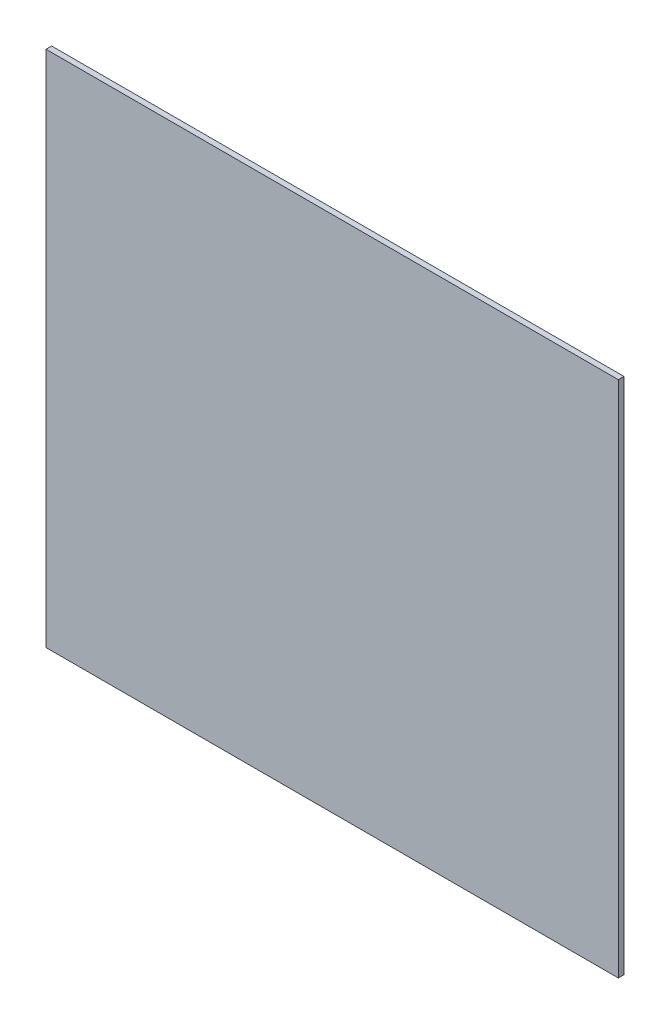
ISO-10303-21;
HEADER;
FILE_DESCRIPTION(('STEP AP214'),'2;1');
FILE_NAME('part.step','',(''),(''),'','','');
FILE_SCHEMA(('AUTOMOTIVE_DESIGN { 1 0 10303 214 1 1 1 1 }'));
ENDSEC;
DATA;
#1=APPLICATION_CONTEXT('core data for automotive mechanical design processes');
#2=APPLICATION_PROTOCOL_DEFINITION('international standard','automotive_design',2000,#1);
#3=PRODUCT_CONTEXT('',#1,'mechanical');
#4=PRODUCT('Part','Part','',(#3));
#5=PRODUCT_RELATED_PRODUCT_CATEGORY('part','',(#4));
#6=PRODUCT_DEFINITION_FORMATION('','',#4);
#7=PRODUCT_DEFINITION_CONTEXT('part definition',#1,'design');
#8=PRODUCT_DEFINITION('design','',#6,#7);
#9=PRODUCT_DEFINITION_SHAPE('','',#8);
#10=(LENGTH_UNIT() NAMED_UNIT(*) SI_UNIT(.MILLI.,.METRE.));
#11=(NAMED_UNIT(*) PLANE_ANGLE_UNIT() SI_UNIT($,.RADIAN.));
#12=(NAMED_UNIT(*) SI_UNIT($,.STERADIAN.) SOLID_ANGLE_UNIT());
#13=UNCERTAINTY_MEASURE_WITH_UNIT(LENGTH_MEASURE(1.E-05),#10,'distance_accuracy_value','');
#14=(GEOMETRIC_REPRESENTATION_CONTEXT(3) GLOBAL_UNCERTAINTY_ASSIGNED_CONTEXT((#13)) GLOBAL_UNIT_ASSIGNED_CONTEXT((#10,
#11,#12)) REPRESENTATION_CONTEXT('',''));
#15=CARTESIAN_POINT('',(0.,0.,0.));
#16=DIRECTION('',(0.,0.,1.));
#17=DIRECTION('',(1.,0.,0.));
#18=AXIS2_PLACEMENT_3D('',#15,#16,#17);
#19=CARTESIAN_POINT('',(-522.852943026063,-701.846010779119,10.));
#20=DIRECTION('',(-1.,0.,0.));
#21=DIRECTION('',(0.,0.,1.));
#22=AXIS2_PLACEMENT_3D('',#19,#20,#21);
#23=PLANE('',#22);
#24=DIRECTION('',(0.,1.,0.));
#25=VECTOR('',#24,1.);
#26=CARTESIAN_POINT('',(-522.852943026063,-701.846010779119,0.));
#27=LINE('',#26,#25);
#28=CARTESIAN_POINT('',(-522.852943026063,-701.846010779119,0.));
#29=VERTEX_POINT('',#28);
#30=CARTESIAN_POINT('',(-522.852943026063,217.153989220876,0.));
#31=VERTEX_POINT('',#30);
#32=EDGE_CURVE('E94',#29,#31,#27,.T.);
#33=ORIENTED_EDGE('',*,*,#32,.T.);
#34=DIRECTION('',(0.,0.,-1.));
#35=VECTOR('',#34,1.);
#36=CARTESIAN_POINT('',(-522.852943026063,217.153989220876,10.));
#37=LINE('',#36,#35);
#38=CARTESIAN_POINT('',(-522.852943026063,217.153989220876,10.));
#39=VERTEX_POINT('',#38);
#40=EDGE_CURVE('E11',#39,#31,#37,.T.);
#41=ORIENTED_EDGE('',*,*,#40,.F.);
#42=DIRECTION('',(0.,1.,0.));
#43=VECTOR('',#42,1.);
#44=CARTESIAN_POINT('',(-522.852943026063,-701.846010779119,10.));
#45=LINE('',#44,#43);
#46=CARTESIAN_POINT('',(-522.852943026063,-701.846010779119,10.));
#47=VERTEX_POINT('',#46);
#48=EDGE_CURVE('E82',#47,#39,#45,.T.);
#49=ORIENTED_EDGE('',*,*,#48,.F.);
#50=DIRECTION('',(0.,0.,-1.));
#51=VECTOR('',#50,1.);
#52=CARTESIAN_POINT('',(-522.852943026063,-701.846010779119,10.));
#53=LINE('',#52,#51);
#54=EDGE_CURVE('E90',#47,#29,#53,.T.);
#55=ORIENTED_EDGE('',*,*,#54,.T.);
#56=EDGE_LOOP('',(#33,#41,#49,#55));
#57=FACE_BOUND('',#56,.T.);
#58=ADVANCED_FACE('F31',(#57),#23,.F.);
#59=CARTESIAN_POINT('',(-522.852943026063,217.153989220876,10.));
#60=DIRECTION('',(0.,-1.,0.));
#61=DIRECTION('',(1.,0.,0.));
#62=AXIS2_PLACEMENT_3D('',#59,#60,#61);
#63=PLANE('',#62);
#64=DIRECTION('',(-1.,0.,0.));
#65=VECTOR('',#64,1.);
#66=CARTESIAN_POINT('',(-522.852943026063,217.153989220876,0.));
#67=LINE('',#66,#65);
#68=CARTESIAN_POINT('',(-1537.85294302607,217.153989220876,0.));
#69=VERTEX_POINT('',#68);
#70=EDGE_CURVE('E86',#31,#69,#67,.T.);
#71=ORIENTED_EDGE('',*,*,#70,.T.);
#72=DIRECTION('',(0.,0.,-1.));
#73=VECTOR('',#72,1.);
#74=CARTESIAN_POINT('',(-1537.85294302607,217.153989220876,10.));
#75=LINE('',#74,#73);
#76=CARTESIAN_POINT('',(-1537.85294302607,217.153989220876,10.));
#77=VERTEX_POINT('',#76);
#78=EDGE_CURVE('E39',#77,#69,#75,.T.);
#79=ORIENTED_EDGE('',*,*,#78,.F.);
#80=DIRECTION('',(-1.,0.,0.));
#81=VECTOR('',#80,1.);
#82=CARTESIAN_POINT('',(-522.852943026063,217.153989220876,10.));
#83=LINE('',#82,#81);
#84=EDGE_CURVE('E77',#39,#77,#83,.T.);
#85=ORIENTED_EDGE('',*,*,#84,.F.);
#86=ORIENTED_EDGE('',*,*,#40,.T.);
#87=EDGE_LOOP('',(#71,#79,#85,#86));
#88=FACE_BOUND('',#87,.T.);
#89=ADVANCED_FACE('F85',(#88),#63,.F.);
#90=CARTESIAN_POINT('',(-1537.85294302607,-701.846010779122,10.));
#91=DIRECTION('',(1.,0.,0.));
#92=DIRECTION('',(0.,0.,-1.));
#93=AXIS2_PLACEMENT_3D('',#90,#91,#92);
#94=PLANE('',#93);
#95=DIRECTION('',(0.,-1.,0.));
#96=VECTOR('',#95,1.);
#97=CARTESIAN_POINT('',(-1537.85294302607,-701.846010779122,0.));
#98=LINE('',#97,#96);
#99=CARTESIAN_POINT('',(-1537.85294302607,-701.846010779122,0.));
#100=VERTEX_POINT('',#99);
#101=EDGE_CURVE('E64',#69,#100,#98,.T.);
#102=ORIENTED_EDGE('',*,*,#101,.T.);
#103=DIRECTION('',(0.,0.,-1.));
#104=VECTOR('',#103,1.);
#105=CARTESIAN_POINT('',(-1537.85294302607,-701.846010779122,10.));
#106=LINE('',#105,#104);
#107=CARTESIAN_POINT('',(-1537.85294302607,-701.846010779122,10.));
#108=VERTEX_POINT('',#107);
#109=EDGE_CURVE('E87',#108,#100,#106,.T.);
#110=ORIENTED_EDGE('',*,*,#109,.F.);
#111=DIRECTION('',(0.,-1.,0.));
#112=VECTOR('',#111,1.);
#113=CARTESIAN_POINT('',(-1537.85294302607,-701.846010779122,10.));
#114=LINE('',#113,#112);
#115=EDGE_CURVE('E80',#77,#108,#114,.T.);
#116=ORIENTED_EDGE('',*,*,#115,.F.);
#117=ORIENTED_EDGE('',*,*,#78,.T.);
#118=EDGE_LOOP('',(#102,#110,#116,#117));
#119=FACE_BOUND('',#118,.T.);
#120=ADVANCED_FACE('F88',(#119),#94,.F.);
#121=CARTESIAN_POINT('',(-522.852943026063,-701.846010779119,10.));
#122=DIRECTION('',(0.,1.,0.));
#123=DIRECTION('',(-1.,0.,0.));
#124=AXIS2_PLACEMENT_3D('',#121,#122,#123);
#125=PLANE('',#124);
#126=DIRECTION('',(1.,0.,0.));
#127=VECTOR('',#126,1.);
#128=CARTESIAN_POINT('',(-522.852943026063,-701.846010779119,0.));
#129=LINE('',#128,#127);
#130=EDGE_CURVE('E70',#100,#29,#129,.T.);
#131=ORIENTED_EDGE('',*,*,#130,.T.);
#132=ORIENTED_EDGE('',*,*,#54,.F.);
#133=DIRECTION('',(1.,0.,0.));
#134=VECTOR('',#133,1.);
#135=CARTESIAN_POINT('',(-522.852943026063,-701.846010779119,10.));
#136=LINE('',#135,#134);
#137=EDGE_CURVE('E47',#108,#47,#136,.T.);
#138=ORIENTED_EDGE('',*,*,#137,.F.);
#139=ORIENTED_EDGE('',*,*,#109,.T.);
#140=EDGE_LOOP('',(#131,#132,#138,#139));
#141=FACE_BOUND('',#140,.T.);
#142=ADVANCED_FACE('F101',(#141),#125,.F.);
#143=CARTESIAN_POINT('',(-522.852943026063,217.153989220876,10.));
#144=DIRECTION('',(0.,0.,1.));
#145=DIRECTION('',(1.,0.,0.));
#146=AXIS2_PLACEMENT_3D('',#143,#144,#145);
#147=PLANE('',#146);
#148=ORIENTED_EDGE('',*,*,#48,.T.);
#149=ORIENTED_EDGE('',*,*,#84,.T.);
#150=ORIENTED_EDGE('',*,*,#115,.T.);
#151=ORIENTED_EDGE('',*,*,#137,.T.);
#152=EDGE_LOOP('',(#148,#149,#150,#151));
#153=FACE_BOUND('',#152,.T.);
#154=ADVANCED_FACE('F78',(#153),#147,.T.);
#155=CARTESIAN_POINT('',(-522.852943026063,217.153989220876,0.));
#156=DIRECTION('',(0.,0.,1.));
#157=DIRECTION('',(1.,0.,0.));
#158=AXIS2_PLACEMENT_3D('',#155,#156,#157);
#159=PLANE('',#158);
#160=ORIENTED_EDGE('',*,*,#32,.F.);
#161=ORIENTED_EDGE('',*,*,#130,.F.);
#162=ORIENTED_EDGE('',*,*,#101,.F.);
#163=ORIENTED_EDGE('',*,*,#70,.F.);
#164=EDGE_LOOP('',(#160,#161,#162,#163));
#165=FACE_BOUND('',#164,.T.);
#166=ADVANCED_FACE('F104',(#165),#159,.F.);
#167=CLOSED_SHELL('',(#58,#89,#120,#142,#154,#166));
#168=MANIFOLD_SOLID_BREP('B2',#167);
#169=ADVANCED_BREP_SHAPE_REPRESENTATION('',(#18,#168),#14);
#170=SHAPE_DEFINITION_REPRESENTATION(#9,#169);
ENDSEC;
END-ISO-10303-21;
